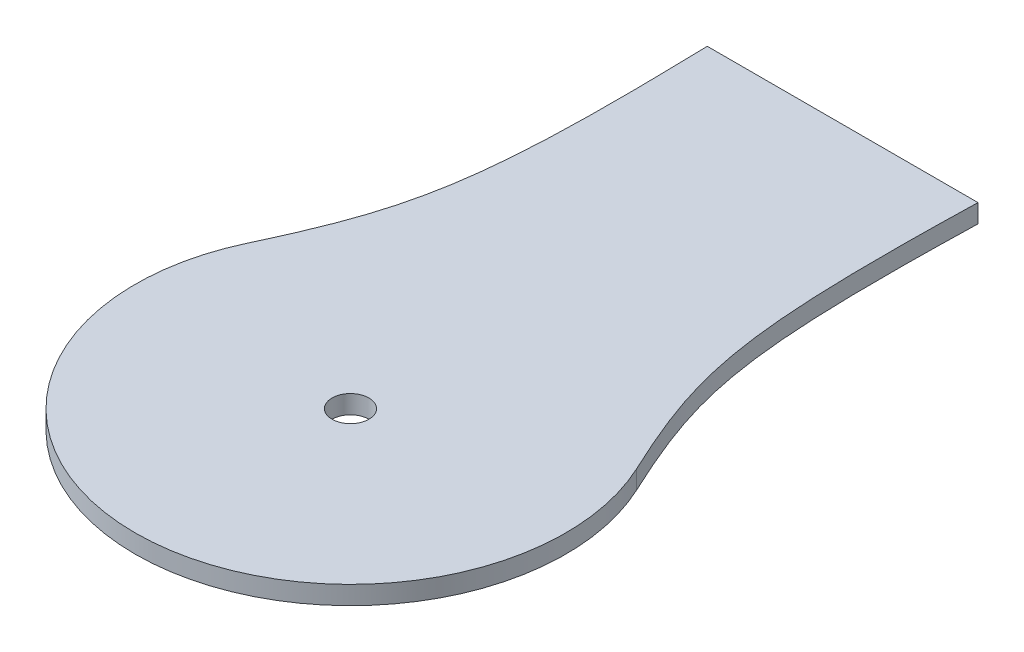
from build123d import *

# Parameters (mm, degrees)
SKIZZE1_R                       = 1.5
AUFSATZ_LINEAR_AUSTRAGEN1_DEPTH = 1.5


with BuildPart() as part:
    # Skizze1 → Aufsatz-Linear austragen1 (new body)
    with BuildSketch(Plane(origin=(0, 0, 0), x_dir=(1, 0, 0), z_dir=(0, 1, 0))):
        with BuildLine():
            Line((-11, 0), (11, 0))
            add(Edge.make_bspline(
                [(15.853697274, -32.589852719), (11.587100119, -23.461648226), (10.507275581, -18.920940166), (11, 0)],
                knots=[0, 0, 0, 0, 1, 1, 1, 1], degree=3))
            ThreePointArc((15.853697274, -32.589852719), (0, -57.5), (-15.853697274, -32.589852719))
            add(Edge.make_bspline(
                [(-15.853697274, -32.589852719), (-11.587100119, -23.461648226), (-10.507275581, -18.920940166), (-11, 0)],
                knots=[0, 0, 0, 0, 1, 1, 1, 1], degree=3))
        make_face()
        with Locations(Location((0, -40, 0), (0, 0, 270))):
            Circle(SKIZZE1_R, mode=Mode.SUBTRACT)
    extrude(amount=AUFSATZ_LINEAR_AUSTRAGEN1_DEPTH)


solid = part.part
